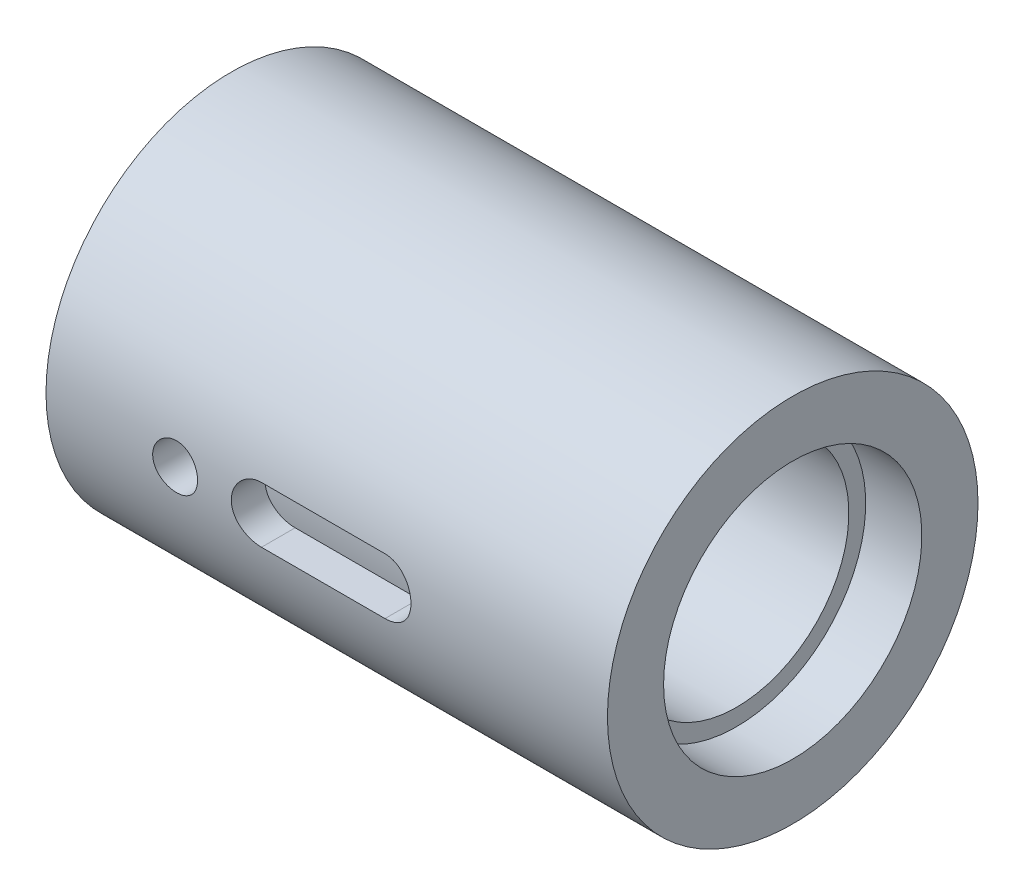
ISO-10303-21;
HEADER;
FILE_DESCRIPTION(('STEP AP214'),'2;1');
FILE_NAME('part.step','',(''),(''),'','','');
FILE_SCHEMA(('AUTOMOTIVE_DESIGN { 1 0 10303 214 1 1 1 1 }'));
ENDSEC;
DATA;
#1=APPLICATION_CONTEXT('core data for automotive mechanical design processes');
#2=APPLICATION_PROTOCOL_DEFINITION('international standard','automotive_design',2000,#1);
#3=PRODUCT_CONTEXT('',#1,'mechanical');
#4=PRODUCT('Part','Part','',(#3));
#5=PRODUCT_RELATED_PRODUCT_CATEGORY('part','',(#4));
#6=PRODUCT_DEFINITION_FORMATION('','',#4);
#7=PRODUCT_DEFINITION_CONTEXT('part definition',#1,'design');
#8=PRODUCT_DEFINITION('design','',#6,#7);
#9=PRODUCT_DEFINITION_SHAPE('','',#8);
#10=(LENGTH_UNIT() NAMED_UNIT(*) SI_UNIT(.MILLI.,.METRE.));
#11=(NAMED_UNIT(*) PLANE_ANGLE_UNIT() SI_UNIT($,.RADIAN.));
#12=(NAMED_UNIT(*) SI_UNIT($,.STERADIAN.) SOLID_ANGLE_UNIT());
#13=UNCERTAINTY_MEASURE_WITH_UNIT(LENGTH_MEASURE(1.E-05),#10,'distance_accuracy_value','');
#14=(GEOMETRIC_REPRESENTATION_CONTEXT(3) GLOBAL_UNCERTAINTY_ASSIGNED_CONTEXT((#13)) GLOBAL_UNIT_ASSIGNED_CONTEXT((#10,
#11,#12)) REPRESENTATION_CONTEXT('',''));
#15=CARTESIAN_POINT('',(0.,0.,0.));
#16=DIRECTION('',(0.,0.,1.));
#17=DIRECTION('',(1.,0.,0.));
#18=AXIS2_PLACEMENT_3D('',#15,#16,#17);
#19=CARTESIAN_POINT('',(25.,16.5,0.));
#20=DIRECTION('',(-1.,0.,0.));
#21=DIRECTION('',(0.,0.,1.));
#22=AXIS2_PLACEMENT_3D('',#19,#20,#21);
#23=PLANE('',#22);
#24=CARTESIAN_POINT('',(25.,0.,0.));
#25=DIRECTION('',(-1.,0.,0.));
#26=DIRECTION('',(0.,0.,1.));
#27=AXIS2_PLACEMENT_3D('',#24,#25,#26);
#28=CIRCLE('',#27,16.5);
#29=CARTESIAN_POINT('',(25.,0.,16.5));
#30=VERTEX_POINT('',#29);
#31=EDGE_CURVE('E112',#30,#30,#28,.T.);
#32=ORIENTED_EDGE('',*,*,#31,.F.);
#33=EDGE_LOOP('',(#32));
#34=FACE_BOUND('',#33,.T.);
#35=CARTESIAN_POINT('',(25.,0.,0.));
#36=DIRECTION('',(-1.,0.,0.));
#37=DIRECTION('',(0.,0.,1.));
#38=AXIS2_PLACEMENT_3D('',#35,#36,#37);
#39=CIRCLE('',#38,11.5);
#40=CARTESIAN_POINT('',(25.,0.,11.5));
#41=VERTEX_POINT('',#40);
#42=EDGE_CURVE('E91',#41,#41,#39,.T.);
#43=ORIENTED_EDGE('',*,*,#42,.T.);
#44=EDGE_LOOP('',(#43));
#45=FACE_BOUND('',#44,.T.);
#46=ADVANCED_FACE('F28',(#34,#45),#23,.F.);
#47=CARTESIAN_POINT('',(0.,0.,0.));
#48=DIRECTION('',(-1.,0.,0.));
#49=DIRECTION('',(0.,0.,1.));
#50=AXIS2_PLACEMENT_3D('',#47,#48,#49);
#51=CYLINDRICAL_SURFACE('',#50,16.5);
#52=CARTESIAN_POINT('',(-11.5,0.,16.5));
#53=CARTESIAN_POINT('',(-11.5000047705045,0.111900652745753,16.4999984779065));
#54=CARTESIAN_POINT('',(-11.5094229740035,0.223871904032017,16.4988496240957));
#55=CARTESIAN_POINT('',(-11.5468464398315,0.444700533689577,16.4943771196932));
#56=CARTESIAN_POINT('',(-11.5748712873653,0.553554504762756,16.4910511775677));
#57=CARTESIAN_POINT('',(-11.6486718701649,0.764919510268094,16.4825993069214));
#58=CARTESIAN_POINT('',(-11.6944358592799,0.867434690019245,16.4774745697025));
#59=CARTESIAN_POINT('',(-11.8023904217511,1.06330969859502,16.4659955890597));
#60=CARTESIAN_POINT('',(-11.8645781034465,1.15667113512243,16.4596415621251));
#61=CARTESIAN_POINT('',(-12.0039600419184,1.33209299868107,16.4463769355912));
#62=CARTESIAN_POINT('',(-12.081222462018,1.41409908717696,16.4394638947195));
#63=CARTESIAN_POINT('',(-12.2484144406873,1.56401456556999,16.4258801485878));
#64=CARTESIAN_POINT('',(-12.3383446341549,1.63192324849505,16.4192094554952));
#65=CARTESIAN_POINT('',(-12.52867056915,1.75191716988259,16.4068415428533));
#66=CARTESIAN_POINT('',(-12.6290984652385,1.80395175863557,16.4011474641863));
#67=CARTESIAN_POINT('',(-12.8373476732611,1.890396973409,16.3914094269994));
#68=CARTESIAN_POINT('',(-12.9451687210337,1.92480822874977,16.3873654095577));
#69=CARTESIAN_POINT('',(-13.1645809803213,1.97486543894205,16.3814085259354));
#70=CARTESIAN_POINT('',(-13.2761510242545,1.99060291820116,16.3794852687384));
#71=CARTESIAN_POINT('',(-13.5003639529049,2.00314900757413,16.3779558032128));
#72=CARTESIAN_POINT('',(-13.6130067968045,1.99995833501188,16.378349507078));
#73=CARTESIAN_POINT('',(-13.835531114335,1.9748138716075,16.3813999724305));
#74=CARTESIAN_POINT('',(-13.9454241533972,1.95296075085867,16.3840445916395));
#75=CARTESIAN_POINT('',(-14.1599716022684,1.89126871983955,16.3912799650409));
#76=CARTESIAN_POINT('',(-14.2646259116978,1.85142946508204,16.3958707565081));
#77=CARTESIAN_POINT('',(-14.4660387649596,1.7547873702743,16.4064950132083));
#78=CARTESIAN_POINT('',(-14.562776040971,1.69794063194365,16.4125322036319));
#79=CARTESIAN_POINT('',(-14.7453758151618,1.56892866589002,16.4253661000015));
#80=CARTESIAN_POINT('',(-14.8312378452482,1.49676277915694,16.4321628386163));
#81=CARTESIAN_POINT('',(-14.9902342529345,1.33860240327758,16.4458040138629));
#82=CARTESIAN_POINT('',(-15.0632823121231,1.25252111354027,16.4526484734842));
#83=CARTESIAN_POINT('',(-15.1939056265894,1.06927274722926,16.4655725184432));
#84=CARTESIAN_POINT('',(-15.2514808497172,0.97210564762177,16.4716521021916));
#85=CARTESIAN_POINT('',(-15.3495236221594,0.769378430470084,16.4823648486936));
#86=CARTESIAN_POINT('',(-15.3899859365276,0.663815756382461,16.4869975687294));
#87=CARTESIAN_POINT('',(-15.4525866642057,0.447325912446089,16.4942905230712));
#88=CARTESIAN_POINT('',(-15.4747258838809,0.336398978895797,16.4969508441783));
#89=CARTESIAN_POINT('',(-15.499940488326,0.113075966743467,16.4999879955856));
#90=CARTESIAN_POINT('',(-15.5031348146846,0.000693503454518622,16.5003790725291));
#91=CARTESIAN_POINT('',(-15.4906825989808,-0.223005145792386,16.4988720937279));
#92=CARTESIAN_POINT('',(-15.4750364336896,-0.334321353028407,16.4969740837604));
#93=CARTESIAN_POINT('',(-15.4254461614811,-0.552377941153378,16.4911111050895));
#94=CARTESIAN_POINT('',(-15.3915585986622,-0.659131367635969,16.48715252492));
#95=CARTESIAN_POINT('',(-15.3065061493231,-0.865439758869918,16.4776117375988));
#96=CARTESIAN_POINT('',(-15.2553407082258,-0.964994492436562,16.4720294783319));
#97=CARTESIAN_POINT('',(-15.1368959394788,-1.15461179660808,16.4598284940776));
#98=CARTESIAN_POINT('',(-15.0695394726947,-1.24462586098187,16.4532048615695));
#99=CARTESIAN_POINT('',(-14.9207340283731,-1.41211356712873,16.4396778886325));
#100=CARTESIAN_POINT('',(-14.8392845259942,-1.48958674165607,16.4327745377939));
#101=CARTESIAN_POINT('',(-14.66408193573,-1.63021400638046,16.4194223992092));
#102=CARTESIAN_POINT('',(-14.5702654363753,-1.69328937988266,16.4129762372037));
#103=CARTESIAN_POINT('',(-14.3733004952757,-1.80278720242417,16.4013110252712));
#104=CARTESIAN_POINT('',(-14.2701522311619,-1.84920996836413,16.3960919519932));
#105=CARTESIAN_POINT('',(-14.0577083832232,-1.9239566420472,16.3874895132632));
#106=CARTESIAN_POINT('',(-13.9484287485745,-1.95232533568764,16.384101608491));
#107=CARTESIAN_POINT('',(-13.7266133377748,-1.99030299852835,16.3795319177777));
#108=CARTESIAN_POINT('',(-13.6140777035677,-1.99991278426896,16.3783500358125));
#109=CARTESIAN_POINT('',(-13.3897277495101,-2.00008547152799,16.3783288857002));
#110=CARTESIAN_POINT('',(-13.2779135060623,-1.99077203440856,16.3794744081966));
#111=CARTESIAN_POINT('',(-13.0574518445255,-1.9536240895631,16.38394634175));
#112=CARTESIAN_POINT('',(-12.9488044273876,-1.92578957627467,16.387272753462));
#113=CARTESIAN_POINT('',(-12.7377742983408,-1.85242753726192,16.3957270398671));
#114=CARTESIAN_POINT('',(-12.6353896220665,-1.80690559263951,16.400854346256));
#115=CARTESIAN_POINT('',(-12.4396926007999,-1.69947310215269,16.4123336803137));
#116=CARTESIAN_POINT('',(-12.3463803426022,-1.63756239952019,16.4186857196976));
#117=CARTESIAN_POINT('',(-12.170844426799,-1.49864990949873,16.4319485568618));
#118=CARTESIAN_POINT('',(-12.0886939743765,-1.42155592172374,16.4388626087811));
#119=CARTESIAN_POINT('',(-11.9384477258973,-1.2546566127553,16.4524415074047));
#120=CARTESIAN_POINT('',(-11.8703552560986,-1.16484829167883,16.4591062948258));
#121=CARTESIAN_POINT('',(-11.7499521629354,-0.974702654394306,16.4714619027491));
#122=CARTESIAN_POINT('',(-11.6976989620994,-0.874328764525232,16.4771491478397));
#123=CARTESIAN_POINT('',(-11.6108634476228,-0.666219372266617,16.4868723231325));
#124=CARTESIAN_POINT('',(-11.576261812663,-0.558492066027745,16.4909100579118));
#125=CARTESIAN_POINT('',(-11.5340517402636,-0.375165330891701,16.4958990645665));
#126=CARTESIAN_POINT('',(-11.5213005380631,-0.300724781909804,16.4974294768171));
#127=CARTESIAN_POINT('',(-11.5042730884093,-0.150866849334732,16.4994804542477));
#128=CARTESIAN_POINT('',(-11.4999967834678,-0.075449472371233,16.5000010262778));
#129=CARTESIAN_POINT('',(-11.5,0.,16.5));
#130=B_SPLINE_CURVE_WITH_KNOTS('',3,(#52,#53,#54,#55,#56,#57,#58,#59,#60,#61,#62,#63,#64,#65,
#66,#67,#68,#69,#70,#71,#72,#73,#74,#75,#76,#77,#78,#79,#80,#81,#82,#83,#84,#85,#86,#87,#88,#89,
#90,#91,#92,#93,#94,#95,#96,#97,#98,#99,#100,#101,#102,#103,#104,#105,#106,#107,#108,#109,#110,
#111,#112,#113,#114,#115,#116,#117,#118,#119,#120,#121,#122,#123,#124,#125,#126,#127,#128,#129),
.UNSPECIFIED.,.T.,.F.,(4,2,2,2,2,2,2,2,2,2,2,2,2,2,2,2,2,2,2,2,2,2,2,2,2,2,2,2,2,2,2,2,2,2,2,2,
2,2,4),(0.,0.335426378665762,0.671206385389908,1.00676443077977,1.34226343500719,
1.6793161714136,2.01638580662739,2.35451994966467,2.69264201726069,3.02909993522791,
3.3655451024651,3.70018677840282,4.03483486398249,4.37035427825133,4.70588812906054,
5.04360200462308,5.38131658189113,5.71913439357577,6.05693733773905,6.39261719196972,
6.72829033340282,7.0629289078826,7.39757822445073,7.7338546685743,8.07014363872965,
8.40822935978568,8.74630864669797,9.08354597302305,9.42076861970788,9.75579463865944,
10.0908207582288,10.4257412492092,10.7606649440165,11.0976889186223,11.4347925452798,
11.7731040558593,12.111044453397,12.3372085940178,12.5633712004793),.UNSPECIFIED.);
#131=CARTESIAN_POINT('',(-11.5,0.,16.5));
#132=VERTEX_POINT('',#131);
#133=EDGE_CURVE('E280',#132,#132,#130,.T.);
#134=ORIENTED_EDGE('',*,*,#133,.F.);
#135=EDGE_LOOP('',(#134));
#136=FACE_BOUND('',#135,.T.);
#137=CARTESIAN_POINT('',(-3.49999999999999,0.,16.5));
#138=CARTESIAN_POINT('',(-3.5000057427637,-0.139568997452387,16.4999977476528));
#139=CARTESIAN_POINT('',(-3.51172716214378,-0.279218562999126,16.4982105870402));
#140=CARTESIAN_POINT('',(-3.55829060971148,-0.554613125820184,16.4912532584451));
#141=CARTESIAN_POINT('',(-3.59315504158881,-0.690354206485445,16.4860798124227));
#142=CARTESIAN_POINT('',(-3.68493786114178,-0.953906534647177,16.4729311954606));
#143=CARTESIAN_POINT('',(-3.74183946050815,-1.08172373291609,16.4649581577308));
#144=CARTESIAN_POINT('',(-3.87604010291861,-1.32597651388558,16.4470909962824));
#145=CARTESIAN_POINT('',(-3.95333635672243,-1.44241364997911,16.4371971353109));
#146=CARTESIAN_POINT('',(-4.12678797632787,-1.66154764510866,16.4165001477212));
#147=CARTESIAN_POINT('',(-4.22307373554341,-1.76414074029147,16.4056910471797));
#148=CARTESIAN_POINT('',(-4.43149056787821,-1.95177906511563,16.3844285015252));
#149=CARTESIAN_POINT('',(-4.54362255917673,-2.0368232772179,16.3739750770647));
#150=CARTESIAN_POINT('',(-4.78124739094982,-2.18735471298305,16.3545494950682));
#151=CARTESIAN_POINT('',(-4.90680463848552,-2.25274134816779,16.3455850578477));
#152=CARTESIAN_POINT('',(-5.16727790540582,-2.36145868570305,16.3302341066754));
#153=CARTESIAN_POINT('',(-5.3021934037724,-2.40479061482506,16.3238474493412));
#154=CARTESIAN_POINT('',(-5.57646137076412,-2.46784584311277,16.3144339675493));
#155=CARTESIAN_POINT('',(-5.71577208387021,-2.48774691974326,16.3113818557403));
#156=CARTESIAN_POINT('',(-5.99578651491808,-2.50392630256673,16.3089062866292));
#157=CARTESIAN_POINT('',(-6.1364901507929,-2.50020599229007,16.3094826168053));
#158=CARTESIAN_POINT('',(-6.4140393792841,-2.46939344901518,16.3141756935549));
#159=CARTESIAN_POINT('',(-6.55090755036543,-2.44249936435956,16.3182624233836));
#160=CARTESIAN_POINT('',(-6.81816600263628,-2.36641294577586,16.3294689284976));
#161=CARTESIAN_POINT('',(-6.94855609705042,-2.31721996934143,16.3365887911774));
#162=CARTESIAN_POINT('',(-7.19975913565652,-2.19772653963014,16.3530924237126));
#163=CARTESIAN_POINT('',(-7.32053161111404,-2.12734229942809,16.3624851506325));
#164=CARTESIAN_POINT('',(-7.5486268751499,-1.96752394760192,16.3824697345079));
#165=CARTESIAN_POINT('',(-7.65594876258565,-1.87808856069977,16.3930616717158));
#166=CARTESIAN_POINT('',(-7.85524464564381,-1.6816196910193,16.4143837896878));
#167=CARTESIAN_POINT('',(-7.94705077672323,-1.57441587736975,16.4251142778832));
#168=CARTESIAN_POINT('',(-8.11139423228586,-1.34603342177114,16.4454040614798));
#169=CARTESIAN_POINT('',(-8.18393146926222,-1.22485471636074,16.454963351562));
#170=CARTESIAN_POINT('',(-8.30768728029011,-0.971815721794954,16.4718439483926));
#171=CARTESIAN_POINT('',(-8.35889273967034,-0.839948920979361,16.4791638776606));
#172=CARTESIAN_POINT('',(-8.43838466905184,-0.569352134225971,16.4907295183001));
#173=CARTESIAN_POINT('',(-8.46667272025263,-0.430622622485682,16.4949754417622));
#174=CARTESIAN_POINT('',(-8.4993032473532,-0.151687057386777,16.4998865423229));
#175=CARTESIAN_POINT('',(-8.5038764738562,-0.011508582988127,16.5005862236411));
#176=CARTESIAN_POINT('',(-8.48956025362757,0.267613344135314,16.49841997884));
#177=CARTESIAN_POINT('',(-8.470671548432,0.406556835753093,16.4955541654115));
#178=CARTESIAN_POINT('',(-8.41015953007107,0.678564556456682,16.4866002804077));
#179=CARTESIAN_POINT('',(-8.36864879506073,0.811654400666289,16.4805281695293));
#180=CARTESIAN_POINT('',(-8.2641898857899,1.068985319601,16.4658402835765));
#181=CARTESIAN_POINT('',(-8.20124068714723,1.19322597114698,16.4572243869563));
#182=CARTESIAN_POINT('',(-8.05515151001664,1.43034535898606,16.4383205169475));
#183=CARTESIAN_POINT('',(-7.97186535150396,1.54313306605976,16.4280206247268));
#184=CARTESIAN_POINT('',(-7.78766975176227,1.75321276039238,16.4069318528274));
#185=CARTESIAN_POINT('',(-7.68675926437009,1.85050382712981,16.3961429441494));
#186=CARTESIAN_POINT('',(-7.46915155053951,2.02766949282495,16.3751825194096));
#187=CARTESIAN_POINT('',(-7.3523276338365,2.10738930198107,16.3650170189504));
#188=CARTESIAN_POINT('',(-7.10681141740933,2.24607312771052,16.3465614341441));
#189=CARTESIAN_POINT('',(-6.97811944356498,2.30503771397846,16.3382712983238));
#190=CARTESIAN_POINT('',(-6.71297927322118,2.40029812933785,16.324548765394));
#191=CARTESIAN_POINT('',(-6.5765607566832,2.43667503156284,16.3191061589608));
#192=CARTESIAN_POINT('',(-6.29946186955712,2.48598526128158,16.3116678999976));
#193=CARTESIAN_POINT('',(-6.15878180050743,2.49892024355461,16.3096720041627));
#194=CARTESIAN_POINT('',(-5.87869627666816,2.50093949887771,16.3093623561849));
#195=CARTESIAN_POINT('',(-5.73929255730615,2.49026717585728,16.3110110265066));
#196=CARTESIAN_POINT('',(-5.46428707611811,2.4458967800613,16.3177230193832));
#197=CARTESIAN_POINT('',(-5.32868530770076,2.41219874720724,16.3227863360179));
#198=CARTESIAN_POINT('',(-5.06520274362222,2.32282019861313,16.3357438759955));
#199=CARTESIAN_POINT('',(-4.9373159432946,2.26715703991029,16.3436358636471));
#200=CARTESIAN_POINT('',(-4.69265697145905,2.13545259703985,16.3613641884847));
#201=CARTESIAN_POINT('',(-4.57588519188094,2.05941059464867,16.3712005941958));
#202=CARTESIAN_POINT('',(-4.35553492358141,1.88822405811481,16.3918301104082));
#203=CARTESIAN_POINT('',(-4.25209718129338,1.79289935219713,16.4026316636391));
#204=CARTESIAN_POINT('',(-4.06259995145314,1.586234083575,16.4239042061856));
#205=CARTESIAN_POINT('',(-3.97654450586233,1.47488980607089,16.4343751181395));
#206=CARTESIAN_POINT('',(-3.82382149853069,1.23860885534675,16.4538739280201));
#207=CARTESIAN_POINT('',(-3.75726565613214,1.11359928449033,16.4628933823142));
#208=CARTESIAN_POINT('',(-3.64619536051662,0.85409719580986,16.4783903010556));
#209=CARTESIAN_POINT('',(-3.60165815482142,0.719614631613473,16.4848703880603));
#210=CARTESIAN_POINT('',(-3.54595532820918,0.487113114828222,16.4930848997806));
#211=CARTESIAN_POINT('',(-3.52874852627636,0.390526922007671,16.4956646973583));
#212=CARTESIAN_POINT('',(-3.50576891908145,0.195973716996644,16.4991230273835));
#213=CARTESIAN_POINT('',(-3.49999596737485,0.0980067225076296,16.5000015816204));
#214=CARTESIAN_POINT('',(-3.49999999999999,0.,16.5));
#215=B_SPLINE_CURVE_WITH_KNOTS('',3,(#137,#138,#139,#140,#141,#142,#143,#144,#145,#146,#147,
#148,#149,#150,#151,#152,#153,#154,#155,#156,#157,#158,#159,#160,#161,#162,#163,#164,#165,#166,
#167,#168,#169,#170,#171,#172,#173,#174,#175,#176,#177,#178,#179,#180,#181,#182,#183,#184,#185,
#186,#187,#188,#189,#190,#191,#192,#193,#194,#195,#196,#197,#198,#199,#200,#201,#202,#203,#204,
#205,#206,#207,#208,#209,#210,#211,#212,#213,#214),.UNSPECIFIED.,.T.,.F.,(4,2,2,2,2,2,2,2,2,2,2,
2,2,2,2,2,2,2,2,2,2,2,2,2,2,2,2,2,2,2,2,2,2,2,2,2,2,2,4),(0.,0.418348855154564,
0.837103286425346,1.25553932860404,1.67391817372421,2.09527670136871,2.51665965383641,
2.94016350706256,3.36364380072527,3.7838898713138,4.20411132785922,4.6207749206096,
5.03745051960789,5.45579571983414,5.87416893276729,6.29681313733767,6.7194592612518,
7.1423648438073,7.56524124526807,7.98399513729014,8.40273579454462,8.81941137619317,
9.23610687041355,9.65589057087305,10.0756991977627,10.4990700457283,10.9224292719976,
11.3442600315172,11.7660610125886,12.1835332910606,12.6010048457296,13.0181471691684,
13.4353041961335,13.8565557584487,14.2779051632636,14.701623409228,15.1249028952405,
15.4186753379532,15.7124440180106),.UNSPECIFIED.);
#216=CARTESIAN_POINT('',(-6.,-2.5,16.3095064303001));
#217=VERTEX_POINT('',#216);
#218=CARTESIAN_POINT('',(-6.,2.5,16.3095064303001));
#219=VERTEX_POINT('',#218);
#220=EDGE_CURVE('E35',#217,#219,#215,.T.);
#221=ORIENTED_EDGE('',*,*,#220,.T.);
#222=DIRECTION('',(-1.,0.,0.));
#223=VECTOR('',#222,1.);
#224=CARTESIAN_POINT('',(0.,2.5,16.3095064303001));
#225=LINE('',#224,#223);
#226=CARTESIAN_POINT('',(5.,2.5,16.3095064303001));
#227=VERTEX_POINT('',#226);
#228=EDGE_CURVE('E11',#219,#227,#225,.F.);
#229=ORIENTED_EDGE('',*,*,#228,.T.);
#230=CARTESIAN_POINT('',(7.50000000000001,0.,16.5));
#231=CARTESIAN_POINT('',(7.4999942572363,-0.139568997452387,16.4999977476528));
#232=CARTESIAN_POINT('',(7.48827283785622,-0.279218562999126,16.4982105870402));
#233=CARTESIAN_POINT('',(7.44170939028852,-0.554613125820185,16.4912532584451));
#234=CARTESIAN_POINT('',(7.40684495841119,-0.690354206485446,16.4860798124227));
#235=CARTESIAN_POINT('',(7.31506213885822,-0.953906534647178,16.4729311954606));
#236=CARTESIAN_POINT('',(7.25816053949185,-1.08172373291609,16.4649581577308));
#237=CARTESIAN_POINT('',(7.12395989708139,-1.32597651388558,16.4470909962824));
#238=CARTESIAN_POINT('',(7.04666364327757,-1.44241364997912,16.4371971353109));
#239=CARTESIAN_POINT('',(6.87321202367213,-1.66154764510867,16.4165001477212));
#240=CARTESIAN_POINT('',(6.77692626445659,-1.76414074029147,16.4056910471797));
#241=CARTESIAN_POINT('',(6.56850943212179,-1.95177906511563,16.3844285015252));
#242=CARTESIAN_POINT('',(6.45637744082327,-2.0368232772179,16.3739750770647));
#243=CARTESIAN_POINT('',(6.21875260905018,-2.18735471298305,16.3545494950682));
#244=CARTESIAN_POINT('',(6.09319536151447,-2.25274134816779,16.3455850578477));
#245=CARTESIAN_POINT('',(5.83272209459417,-2.36145868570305,16.3302341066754));
#246=CARTESIAN_POINT('',(5.69780659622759,-2.40479061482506,16.3238474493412));
#247=CARTESIAN_POINT('',(5.42353862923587,-2.46784584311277,16.3144339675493));
#248=CARTESIAN_POINT('',(5.28422791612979,-2.48774691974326,16.3113818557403));
#249=CARTESIAN_POINT('',(5.00421348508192,-2.50392630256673,16.3089062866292));
#250=CARTESIAN_POINT('',(4.8635098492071,-2.50020599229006,16.3094826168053));
#251=CARTESIAN_POINT('',(4.5859606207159,-2.46939344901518,16.3141756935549));
#252=CARTESIAN_POINT('',(4.44909244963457,-2.44249936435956,16.3182624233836));
#253=CARTESIAN_POINT('',(4.18183399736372,-2.36641294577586,16.3294689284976));
#254=CARTESIAN_POINT('',(4.05144390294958,-2.31721996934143,16.3365887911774));
#255=CARTESIAN_POINT('',(3.80024086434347,-2.19772653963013,16.3530924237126));
#256=CARTESIAN_POINT('',(3.67946838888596,-2.12734229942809,16.3624851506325));
#257=CARTESIAN_POINT('',(3.4513731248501,-1.96752394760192,16.3824697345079));
#258=CARTESIAN_POINT('',(3.34405123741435,-1.87808856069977,16.3930616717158));
#259=CARTESIAN_POINT('',(3.14475535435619,-1.6816196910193,16.4143837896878));
#260=CARTESIAN_POINT('',(3.05294922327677,-1.57441587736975,16.4251142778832));
#261=CARTESIAN_POINT('',(2.88860576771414,-1.34603342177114,16.4454040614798));
#262=CARTESIAN_POINT('',(2.81606853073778,-1.22485471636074,16.454963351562));
#263=CARTESIAN_POINT('',(2.69231271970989,-0.97181572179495,16.4718439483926));
#264=CARTESIAN_POINT('',(2.64110726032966,-0.839948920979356,16.4791638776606));
#265=CARTESIAN_POINT('',(2.56161533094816,-0.569352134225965,16.4907295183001));
#266=CARTESIAN_POINT('',(2.53332727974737,-0.430622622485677,16.4949754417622));
#267=CARTESIAN_POINT('',(2.5006967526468,-0.151687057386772,16.4998865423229));
#268=CARTESIAN_POINT('',(2.4961235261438,-0.0115085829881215,16.5005862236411));
#269=CARTESIAN_POINT('',(2.51043974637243,0.267613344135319,16.49841997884));
#270=CARTESIAN_POINT('',(2.529328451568,0.406556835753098,16.4955541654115));
#271=CARTESIAN_POINT('',(2.58984046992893,0.678564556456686,16.4866002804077));
#272=CARTESIAN_POINT('',(2.63135120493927,0.811654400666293,16.4805281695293));
#273=CARTESIAN_POINT('',(2.7358101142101,1.068985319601,16.4658402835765));
#274=CARTESIAN_POINT('',(2.79875931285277,1.19322597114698,16.4572243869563));
#275=CARTESIAN_POINT('',(2.94484848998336,1.43034535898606,16.4383205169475));
#276=CARTESIAN_POINT('',(3.02813464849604,1.54313306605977,16.4280206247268));
#277=CARTESIAN_POINT('',(3.21233024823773,1.75321276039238,16.4069318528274));
#278=CARTESIAN_POINT('',(3.31324073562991,1.85050382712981,16.3961429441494));
#279=CARTESIAN_POINT('',(3.53084844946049,2.02766949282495,16.3751825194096));
#280=CARTESIAN_POINT('',(3.6476723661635,2.10738930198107,16.3650170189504));
#281=CARTESIAN_POINT('',(3.89318858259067,2.24607312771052,16.3465614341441));
#282=CARTESIAN_POINT('',(4.02188055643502,2.30503771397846,16.3382712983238));
#283=CARTESIAN_POINT('',(4.28702072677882,2.40029812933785,16.324548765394));
#284=CARTESIAN_POINT('',(4.42343924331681,2.43667503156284,16.3191061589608));
#285=CARTESIAN_POINT('',(4.70053813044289,2.48598526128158,16.3116678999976));
#286=CARTESIAN_POINT('',(4.84121819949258,2.49892024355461,16.3096720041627));
#287=CARTESIAN_POINT('',(5.12130372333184,2.50093949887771,16.3093623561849));
#288=CARTESIAN_POINT('',(5.26070744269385,2.49026717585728,16.3110110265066));
#289=CARTESIAN_POINT('',(5.53571292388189,2.4458967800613,16.3177230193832));
#290=CARTESIAN_POINT('',(5.67131469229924,2.41219874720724,16.3227863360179));
#291=CARTESIAN_POINT('',(5.93479725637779,2.32282019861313,16.3357438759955));
#292=CARTESIAN_POINT('',(6.0626840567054,2.26715703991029,16.3436358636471));
#293=CARTESIAN_POINT('',(6.30734302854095,2.13545259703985,16.3613641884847));
#294=CARTESIAN_POINT('',(6.42411480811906,2.05941059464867,16.3712005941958));
#295=CARTESIAN_POINT('',(6.6444650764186,1.88822405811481,16.3918301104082));
#296=CARTESIAN_POINT('',(6.74790281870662,1.79289935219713,16.4026316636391));
#297=CARTESIAN_POINT('',(6.93740004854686,1.586234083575,16.4239042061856));
#298=CARTESIAN_POINT('',(7.02345549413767,1.47488980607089,16.4343751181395));
#299=CARTESIAN_POINT('',(7.17617850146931,1.23860885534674,16.4538739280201));
#300=CARTESIAN_POINT('',(7.24273434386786,1.11359928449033,16.4628933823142));
#301=CARTESIAN_POINT('',(7.35380463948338,0.854097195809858,16.4783903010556));
#302=CARTESIAN_POINT('',(7.39834184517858,0.719614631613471,16.4848703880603));
#303=CARTESIAN_POINT('',(7.45404467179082,0.48711311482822,16.4930848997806));
#304=CARTESIAN_POINT('',(7.47125147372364,0.390526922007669,16.4956646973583));
#305=CARTESIAN_POINT('',(7.49423108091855,0.195973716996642,16.4991230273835));
#306=CARTESIAN_POINT('',(7.50000403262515,0.098006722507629,16.5000015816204));
#307=CARTESIAN_POINT('',(7.50000000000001,0.,16.5));
#308=B_SPLINE_CURVE_WITH_KNOTS('',3,(#230,#231,#232,#233,#234,#235,#236,#237,#238,#239,#240,
#241,#242,#243,#244,#245,#246,#247,#248,#249,#250,#251,#252,#253,#254,#255,#256,#257,#258,#259,
#260,#261,#262,#263,#264,#265,#266,#267,#268,#269,#270,#271,#272,#273,#274,#275,#276,#277,#278,
#279,#280,#281,#282,#283,#284,#285,#286,#287,#288,#289,#290,#291,#292,#293,#294,#295,#296,#297,
#298,#299,#300,#301,#302,#303,#304,#305,#306,#307),.UNSPECIFIED.,.T.,.F.,(4,2,2,2,2,2,2,2,2,2,2,
2,2,2,2,2,2,2,2,2,2,2,2,2,2,2,2,2,2,2,2,2,2,2,2,2,2,2,4),(0.,0.418348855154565,
0.837103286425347,1.25553932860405,1.67391817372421,2.09527670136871,2.51665965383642,
2.94016350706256,3.36364380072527,3.7838898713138,4.20411132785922,4.6207749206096,
5.03745051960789,5.45579571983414,5.87416893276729,6.29681313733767,6.7194592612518,
7.1423648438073,7.56524124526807,7.98399513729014,8.40273579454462,8.81941137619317,
9.23610687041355,9.65589057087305,10.0756991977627,10.4990700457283,10.9224292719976,
11.3442600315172,11.7660610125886,12.1835332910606,12.6010048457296,13.0181471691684,
13.4353041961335,13.8565557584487,14.2779051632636,14.701623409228,15.1249028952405,
15.4186753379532,15.7124440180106),.UNSPECIFIED.);
#309=CARTESIAN_POINT('',(5.,-2.5,16.3095064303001));
#310=VERTEX_POINT('',#309);
#311=EDGE_CURVE('E115',#227,#310,#308,.T.);
#312=ORIENTED_EDGE('',*,*,#311,.T.);
#313=DIRECTION('',(-1.,0.,0.));
#314=VECTOR('',#313,1.);
#315=CARTESIAN_POINT('',(0.,-2.5,16.3095064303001));
#316=LINE('',#315,#314);
#317=EDGE_CURVE('E121',#310,#217,#316,.T.);
#318=ORIENTED_EDGE('',*,*,#317,.T.);
#319=EDGE_LOOP('',(#221,#229,#312,#318));
#320=FACE_BOUND('',#319,.T.);
#321=CARTESIAN_POINT('',(-25.,0.,0.));
#322=DIRECTION('',(-1.,0.,0.));
#323=DIRECTION('',(0.,0.,1.));
#324=AXIS2_PLACEMENT_3D('',#321,#322,#323);
#325=CIRCLE('',#324,16.5);
#326=CARTESIAN_POINT('',(-25.,0.,16.5));
#327=VERTEX_POINT('',#326);
#328=EDGE_CURVE('E109',#327,#327,#325,.T.);
#329=ORIENTED_EDGE('',*,*,#328,.F.);
#330=EDGE_LOOP('',(#329));
#331=FACE_BOUND('',#330,.T.);
#332=ORIENTED_EDGE('',*,*,#31,.T.);
#333=EDGE_LOOP('',(#332));
#334=FACE_BOUND('',#333,.T.);
#335=ADVANCED_FACE('F122',(#136,#320,#331,#334),#51,.T.);
#336=CARTESIAN_POINT('',(-25.,16.5,0.));
#337=DIRECTION('',(1.,0.,0.));
#338=DIRECTION('',(0.,0.,-1.));
#339=AXIS2_PLACEMENT_3D('',#336,#337,#338);
#340=PLANE('',#339);
#341=CARTESIAN_POINT('',(-25.,0.,0.));
#342=DIRECTION('',(-1.,0.,0.));
#343=DIRECTION('',(0.,0.,1.));
#344=AXIS2_PLACEMENT_3D('',#341,#342,#343);
#345=CIRCLE('',#344,11.5);
#346=CARTESIAN_POINT('',(-25.,0.,11.5));
#347=VERTEX_POINT('',#346);
#348=EDGE_CURVE('E106',#347,#347,#345,.T.);
#349=ORIENTED_EDGE('',*,*,#348,.F.);
#350=EDGE_LOOP('',(#349));
#351=FACE_BOUND('',#350,.T.);
#352=ORIENTED_EDGE('',*,*,#328,.T.);
#353=EDGE_LOOP('',(#352));
#354=FACE_BOUND('',#353,.T.);
#355=ADVANCED_FACE('F176',(#351,#354),#340,.F.);
#356=CARTESIAN_POINT('',(0.,0.,0.));
#357=DIRECTION('',(-1.,0.,0.));
#358=DIRECTION('',(0.,0.,1.));
#359=AXIS2_PLACEMENT_3D('',#356,#357,#358);
#360=CYLINDRICAL_SURFACE('',#359,11.5);
#361=CARTESIAN_POINT('',(-20.,0.,0.));
#362=DIRECTION('',(-1.,0.,0.));
#363=DIRECTION('',(0.,0.,1.));
#364=AXIS2_PLACEMENT_3D('',#361,#362,#363);
#365=CIRCLE('',#364,11.5);
#366=CARTESIAN_POINT('',(-20.,0.,11.5));
#367=VERTEX_POINT('',#366);
#368=EDGE_CURVE('E103',#367,#367,#365,.T.);
#369=ORIENTED_EDGE('',*,*,#368,.F.);
#370=EDGE_LOOP('',(#369));
#371=FACE_BOUND('',#370,.T.);
#372=ORIENTED_EDGE('',*,*,#348,.T.);
#373=EDGE_LOOP('',(#372));
#374=FACE_BOUND('',#373,.T.);
#375=ADVANCED_FACE('F201',(#371,#374),#360,.F.);
#376=CARTESIAN_POINT('',(-20.,11.5,0.));
#377=DIRECTION('',(1.,0.,0.));
#378=DIRECTION('',(0.,0.,-1.));
#379=AXIS2_PLACEMENT_3D('',#376,#377,#378);
#380=PLANE('',#379);
#381=CARTESIAN_POINT('',(-20.,0.,0.));
#382=DIRECTION('',(-1.,0.,0.));
#383=DIRECTION('',(0.,0.,1.));
#384=AXIS2_PLACEMENT_3D('',#381,#382,#383);
#385=CIRCLE('',#384,9.99999999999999);
#386=CARTESIAN_POINT('',(-20.,0.,9.99999999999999));
#387=VERTEX_POINT('',#386);
#388=EDGE_CURVE('E100',#387,#387,#385,.T.);
#389=ORIENTED_EDGE('',*,*,#388,.F.);
#390=EDGE_LOOP('',(#389));
#391=FACE_BOUND('',#390,.T.);
#392=ORIENTED_EDGE('',*,*,#368,.T.);
#393=EDGE_LOOP('',(#392));
#394=FACE_BOUND('',#393,.T.);
#395=ADVANCED_FACE('F194',(#391,#394),#380,.F.);
#396=CARTESIAN_POINT('',(0.,0.,0.));
#397=DIRECTION('',(-1.,0.,0.));
#398=DIRECTION('',(0.,0.,1.));
#399=AXIS2_PLACEMENT_3D('',#396,#397,#398);
#400=CYLINDRICAL_SURFACE('',#399,9.99999999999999);
#401=CARTESIAN_POINT('',(-11.5,0.,9.99999999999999));
#402=CARTESIAN_POINT('',(-11.5000040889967,-0.111153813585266,9.99999795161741));
#403=CARTESIAN_POINT('',(-11.5092976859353,-0.222359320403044,9.99812770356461));
#404=CARTESIAN_POINT('',(-11.5461970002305,-0.441627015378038,9.99084731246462));
#405=CARTESIAN_POINT('',(-11.573817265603,-0.549686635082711,9.98543435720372));
#406=CARTESIAN_POINT('',(-11.6464825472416,-0.759460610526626,9.97167298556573));
#407=CARTESIAN_POINT('',(-11.6915108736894,-0.861180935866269,9.96332738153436));
#408=CARTESIAN_POINT('',(-11.7976644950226,-1.05561597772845,9.94460796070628));
#409=CARTESIAN_POINT('',(-11.8587888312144,-1.14833123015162,9.93423426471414));
#410=CARTESIAN_POINT('',(-11.9962769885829,-1.32338695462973,9.91244330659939));
#411=CARTESIAN_POINT('',(-12.0728167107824,-1.40558790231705,9.90101491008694));
#412=CARTESIAN_POINT('',(-12.2385848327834,-1.55607351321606,9.87848360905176));
#413=CARTESIAN_POINT('',(-12.3278142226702,-1.62435708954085,9.86738073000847));
#414=CARTESIAN_POINT('',(-12.5174323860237,-1.74566350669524,9.8466488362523));
#415=CARTESIAN_POINT('',(-12.6179152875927,-1.79854187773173,9.83703414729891));
#416=CARTESIAN_POINT('',(-12.8265636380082,-1.88661133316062,9.82052536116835));
#417=CARTESIAN_POINT('',(-12.9347283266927,-1.92180416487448,9.81363099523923));
#418=CARTESIAN_POINT('',(-13.1541687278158,-1.97305059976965,9.80345610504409));
#419=CARTESIAN_POINT('',(-13.2653850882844,-1.98934899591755,9.80012940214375));
#420=CARTESIAN_POINT('',(-13.4890196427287,-2.00310425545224,9.79732750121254));
#421=CARTESIAN_POINT('',(-13.6014377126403,-2.000563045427,9.79785190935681));
#422=CARTESIAN_POINT('',(-13.822493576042,-1.97690914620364,9.80265102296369));
#423=CARTESIAN_POINT('',(-13.9311628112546,-1.95607708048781,9.80686905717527));
#424=CARTESIAN_POINT('',(-14.143432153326,-1.8968757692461,9.81849092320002));
#425=CARTESIAN_POINT('',(-14.247032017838,-1.85850568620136,9.82589490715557));
#426=CARTESIAN_POINT('',(-14.4470305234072,-1.76504956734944,9.84311237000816));
#427=CARTESIAN_POINT('',(-14.5433757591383,-1.70985230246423,9.85294179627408));
#428=CARTESIAN_POINT('',(-14.7255416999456,-1.58438714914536,9.87389237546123));
#429=CARTESIAN_POINT('',(-14.8113611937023,-1.51411752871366,9.88501367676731));
#430=CARTESIAN_POINT('',(-14.9716588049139,-1.35899986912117,9.90754042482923));
#431=CARTESIAN_POINT('',(-15.0459051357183,-1.27391232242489,9.91894738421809));
#432=CARTESIAN_POINT('',(-15.1791076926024,-1.09237004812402,9.94057697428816));
#433=CARTESIAN_POINT('',(-15.2380637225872,-0.995915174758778,9.95079958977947));
#434=CARTESIAN_POINT('',(-15.3390550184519,-0.794118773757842,9.96893380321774));
#435=CARTESIAN_POINT('',(-15.3810637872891,-0.688763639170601,9.97684177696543));
#436=CARTESIAN_POINT('',(-15.4467209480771,-0.47229795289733,9.98942817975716));
#437=CARTESIAN_POINT('',(-15.4703715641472,-0.361188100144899,9.99410700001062));
#438=CARTESIAN_POINT('',(-15.4983129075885,-0.138358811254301,9.99965343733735));
#439=CARTESIAN_POINT('',(-15.5029208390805,-0.0266806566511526,10.0005834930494));
#440=CARTESIAN_POINT('',(-15.4935002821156,0.195849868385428,9.99870103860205));
#441=CARTESIAN_POINT('',(-15.4794728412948,0.306702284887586,9.99588873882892));
#442=CARTESIAN_POINT('',(-15.4334432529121,0.523411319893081,9.98687664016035));
#443=CARTESIAN_POINT('',(-15.4016038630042,0.629303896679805,9.98070752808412));
#444=CARTESIAN_POINT('',(-15.3210320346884,0.834247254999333,9.96567104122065));
#445=CARTESIAN_POINT('',(-15.2722983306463,0.933297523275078,9.95680346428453));
#446=CARTESIAN_POINT('',(-15.1586350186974,1.12308234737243,9.93719823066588));
#447=CARTESIAN_POINT('',(-15.0935144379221,1.21370025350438,9.92643900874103));
#448=CARTESIAN_POINT('',(-14.9491816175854,1.38283603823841,9.90429469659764));
#449=CARTESIAN_POINT('',(-14.8699678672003,1.46135261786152,9.89290953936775));
#450=CARTESIAN_POINT('',(-14.6982532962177,1.60528118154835,9.87058607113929));
#451=CARTESIAN_POINT('',(-14.6055685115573,1.67047540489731,9.85965720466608));
#452=CARTESIAN_POINT('',(-14.4103772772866,1.78437084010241,9.83968383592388));
#453=CARTESIAN_POINT('',(-14.3078712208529,1.83307271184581,9.83063925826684));
#454=CARTESIAN_POINT('',(-14.0964635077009,1.91230368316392,9.81553481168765));
#455=CARTESIAN_POINT('',(-13.9875983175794,1.9429269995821,9.80945949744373));
#456=CARTESIAN_POINT('',(-13.7661330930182,1.98541730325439,9.8009487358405));
#457=CARTESIAN_POINT('',(-13.6535335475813,1.99728673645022,9.79851281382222));
#458=CARTESIAN_POINT('',(-13.4299822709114,2.00184182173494,9.79758299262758));
#459=CARTESIAN_POINT('',(-13.319037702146,1.99487157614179,9.79901838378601));
#460=CARTESIAN_POINT('',(-13.0999367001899,1.96270460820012,9.80551146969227));
#461=CARTESIAN_POINT('',(-12.9917802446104,1.9375080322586,9.81056913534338));
#462=CARTESIAN_POINT('',(-12.7815445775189,1.86975713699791,9.82370528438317));
#463=CARTESIAN_POINT('',(-12.6794512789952,1.82724501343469,9.83177642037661));
#464=CARTESIAN_POINT('',(-12.4837925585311,1.72610928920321,9.8500342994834));
#465=CARTESIAN_POINT('',(-12.3902278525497,1.66748433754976,9.86022121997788));
#466=CARTESIAN_POINT('',(-12.2125688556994,1.53461182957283,9.8817792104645));
#467=CARTESIAN_POINT('',(-12.1286624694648,1.46011577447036,9.89316745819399));
#468=CARTESIAN_POINT('',(-11.9744275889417,1.29812873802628,9.91572163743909));
#469=CARTESIAN_POINT('',(-11.9041022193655,1.21063477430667,9.92688751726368));
#470=CARTESIAN_POINT('',(-11.7783307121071,1.02403525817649,9.94787664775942));
#471=CARTESIAN_POINT('',(-11.7230479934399,0.924817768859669,9.95768462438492));
#472=CARTESIAN_POINT('',(-11.6300277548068,0.718332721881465,9.97470250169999));
#473=CARTESIAN_POINT('',(-11.592274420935,0.611072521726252,9.98191474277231));
#474=CARTESIAN_POINT('',(-11.5426961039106,0.419642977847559,9.99152745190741));
#475=CARTESIAN_POINT('',(-11.5267136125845,0.336563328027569,9.99468606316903));
#476=CARTESIAN_POINT('',(-11.5053641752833,0.168999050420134,9.99892308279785));
#477=CARTESIAN_POINT('',(-11.4999968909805,0.084514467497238,10.0000015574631));
#478=CARTESIAN_POINT('',(-11.5,0.,9.99999999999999));
#479=B_SPLINE_CURVE_WITH_KNOTS('',3,(#401,#402,#403,#404,#405,#406,#407,#408,#409,#410,#411,
#412,#413,#414,#415,#416,#417,#418,#419,#420,#421,#422,#423,#424,#425,#426,#427,#428,#429,#430,
#431,#432,#433,#434,#435,#436,#437,#438,#439,#440,#441,#442,#443,#444,#445,#446,#447,#448,#449,
#450,#451,#452,#453,#454,#455,#456,#457,#458,#459,#460,#461,#462,#463,#464,#465,#466,#467,#468,
#469,#470,#471,#472,#473,#474,#475,#476,#477,#478),.UNSPECIFIED.,.T.,.F.,(4,2,2,2,2,2,2,2,2,2,2,
2,2,2,2,2,2,2,2,2,2,2,2,2,2,2,2,2,2,2,2,2,2,2,2,2,2,2,4),(0.,0.333152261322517,
0.666569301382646,0.999667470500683,1.33274580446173,1.66986534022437,2.00701119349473,
2.34722390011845,2.68740298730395,3.02312370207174,3.3588100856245,3.68943454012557,
4.02007478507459,4.35294980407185,4.68586309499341,5.02476504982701,5.3636713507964,
5.70310549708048,6.04249851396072,6.3762147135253,6.70991215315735,7.04060907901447,
7.37133078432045,7.70610132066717,8.0409077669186,8.38081257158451,8.72070377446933,
9.05880762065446,9.39686736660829,9.72879445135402,10.0607188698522,10.3918392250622,
10.7229873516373,11.0597615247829,11.3966130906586,11.7369899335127,12.0770591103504,
12.3303755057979,12.5836838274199),.UNSPECIFIED.);
#480=CARTESIAN_POINT('',(-11.5,0.,9.99999999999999));
#481=VERTEX_POINT('',#480);
#482=EDGE_CURVE('E154',#481,#481,#479,.T.);
#483=ORIENTED_EDGE('',*,*,#482,.F.);
#484=EDGE_LOOP('',(#483));
#485=FACE_BOUND('',#484,.T.);
#486=CARTESIAN_POINT('',(20.,0.,0.));
#487=DIRECTION('',(-1.,0.,0.));
#488=DIRECTION('',(0.,0.,1.));
#489=AXIS2_PLACEMENT_3D('',#486,#487,#488);
#490=CIRCLE('',#489,9.99999999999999);
#491=CARTESIAN_POINT('',(20.,0.,9.99999999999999));
#492=VERTEX_POINT('',#491);
#493=EDGE_CURVE('E97',#492,#492,#490,.T.);
#494=ORIENTED_EDGE('',*,*,#493,.F.);
#495=EDGE_LOOP('',(#494));
#496=FACE_BOUND('',#495,.T.);
#497=ORIENTED_EDGE('',*,*,#388,.T.);
#498=EDGE_LOOP('',(#497));
#499=FACE_BOUND('',#498,.T.);
#500=ADVANCED_FACE('F189',(#485,#496,#499),#400,.F.);
#501=CARTESIAN_POINT('',(20.,11.5,0.));
#502=DIRECTION('',(-1.,0.,0.));
#503=DIRECTION('',(0.,0.,1.));
#504=AXIS2_PLACEMENT_3D('',#501,#502,#503);
#505=PLANE('',#504);
#506=CARTESIAN_POINT('',(20.,0.,0.));
#507=DIRECTION('',(-1.,0.,0.));
#508=DIRECTION('',(0.,0.,1.));
#509=AXIS2_PLACEMENT_3D('',#506,#507,#508);
#510=CIRCLE('',#509,11.5);
#511=CARTESIAN_POINT('',(20.,0.,11.5));
#512=VERTEX_POINT('',#511);
#513=EDGE_CURVE('E94',#512,#512,#510,.T.);
#514=ORIENTED_EDGE('',*,*,#513,.F.);
#515=EDGE_LOOP('',(#514));
#516=FACE_BOUND('',#515,.T.);
#517=ORIENTED_EDGE('',*,*,#493,.T.);
#518=EDGE_LOOP('',(#517));
#519=FACE_BOUND('',#518,.T.);
#520=ADVANCED_FACE('F184',(#516,#519),#505,.F.);
#521=CARTESIAN_POINT('',(0.,0.,0.));
#522=DIRECTION('',(-1.,0.,0.));
#523=DIRECTION('',(0.,0.,1.));
#524=AXIS2_PLACEMENT_3D('',#521,#522,#523);
#525=CYLINDRICAL_SURFACE('',#524,11.5);
#526=ORIENTED_EDGE('',*,*,#42,.F.);
#527=EDGE_LOOP('',(#526));
#528=FACE_BOUND('',#527,.T.);
#529=ORIENTED_EDGE('',*,*,#513,.T.);
#530=EDGE_LOOP('',(#529));
#531=FACE_BOUND('',#530,.T.);
#532=ADVANCED_FACE('F132',(#528,#531),#525,.F.);
#533=CARTESIAN_POINT('',(-6.,2.5,-22.501));
#534=DIRECTION('',(0.,1.,0.));
#535=DIRECTION('',(-1.,0.,0.));
#536=AXIS2_PLACEMENT_3D('',#533,#534,#535);
#537=PLANE('',#536);
#538=DIRECTION('',(0.,0.,1.));
#539=VECTOR('',#538,1.);
#540=CARTESIAN_POINT('',(-6.,2.5,-22.501));
#541=LINE('',#540,#539);
#542=CARTESIAN_POINT('',(-6.,2.5,13.3095064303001));
#543=VERTEX_POINT('',#542);
#544=EDGE_CURVE('E70',#543,#219,#541,.T.);
#545=ORIENTED_EDGE('',*,*,#544,.F.);
#546=DIRECTION('',(-1.,0.,0.));
#547=VECTOR('',#546,1.);
#548=CARTESIAN_POINT('',(0.,2.5,13.3095064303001));
#549=LINE('',#548,#547);
#550=CARTESIAN_POINT('',(5.,2.5,13.3095064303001));
#551=VERTEX_POINT('',#550);
#552=EDGE_CURVE('E78',#551,#543,#549,.T.);
#553=ORIENTED_EDGE('',*,*,#552,.F.);
#554=DIRECTION('',(0.,0.,1.));
#555=VECTOR('',#554,1.);
#556=CARTESIAN_POINT('',(5.,2.5,-22.501));
#557=LINE('',#556,#555);
#558=EDGE_CURVE('E82',#551,#227,#557,.T.);
#559=ORIENTED_EDGE('',*,*,#558,.T.);
#560=ORIENTED_EDGE('',*,*,#228,.F.);
#561=EDGE_LOOP('',(#545,#553,#559,#560));
#562=FACE_BOUND('',#561,.T.);
#563=ADVANCED_FACE('F80',(#562),#537,.F.);
#564=CARTESIAN_POINT('',(-5.99999999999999,0.,-22.501));
#565=DIRECTION('',(0.,0.,1.));
#566=DIRECTION('',(1.,0.,0.));
#567=AXIS2_PLACEMENT_3D('',#564,#565,#566);
#568=CYLINDRICAL_SURFACE('',#567,2.5);
#569=DIRECTION('',(0.,0.,1.));
#570=VECTOR('',#569,1.);
#571=CARTESIAN_POINT('',(-6.,-2.5,-22.501));
#572=LINE('',#571,#570);
#573=CARTESIAN_POINT('',(-6.,-2.5,13.3095064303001));
#574=VERTEX_POINT('',#573);
#575=EDGE_CURVE('E73',#574,#217,#572,.T.);
#576=ORIENTED_EDGE('',*,*,#575,.F.);
#577=CARTESIAN_POINT('',(-6.,2.5,13.3095064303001));
#578=CARTESIAN_POINT('',(-6.06988495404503,2.50000720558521,13.3095019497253));
#579=CARTESIAN_POINT('',(-6.13976615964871,2.49706971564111,13.3099555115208));
#580=CARTESIAN_POINT('',(-6.27902060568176,2.48536118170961,13.3117455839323));
#581=CARTESIAN_POINT('',(-6.34839389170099,2.47659066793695,13.3130820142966));
#582=CARTESIAN_POINT('',(-6.48606412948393,2.45328557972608,13.3166026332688));
#583=CARTESIAN_POINT('',(-6.55436224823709,2.43875777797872,13.3187858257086));
#584=CARTESIAN_POINT('',(-6.68946051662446,2.40406215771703,13.3239330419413));
#585=CARTESIAN_POINT('',(-6.75626067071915,2.38389435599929,13.3268970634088));
#586=CARTESIAN_POINT('',(-6.95374468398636,2.3151154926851,13.3368424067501));
#587=CARTESIAN_POINT('',(-7.0815992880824,2.25821411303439,13.3448793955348));
#588=CARTESIAN_POINT('',(-7.3258741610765,2.12403092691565,13.3628555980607));
#589=CARTESIAN_POINT('',(-7.44229469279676,2.04674958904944,13.3727947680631));
#590=CARTESIAN_POINT('',(-7.66142753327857,1.87331535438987,13.3935460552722));
#591=CARTESIAN_POINT('',(-7.76403514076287,1.77703062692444,13.4043639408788));
#592=CARTESIAN_POINT('',(-7.95170731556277,1.56860204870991,13.4256031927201));
#593=CARTESIAN_POINT('',(-8.0367692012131,1.456455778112,13.4360244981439));
#594=CARTESIAN_POINT('',(-8.18732064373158,1.21881344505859,13.4553563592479));
#595=CARTESIAN_POINT('',(-8.25271255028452,1.09325483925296,13.464259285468));
#596=CARTESIAN_POINT('',(-8.36143577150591,0.83278650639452,13.4794861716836));
#597=CARTESIAN_POINT('',(-8.40476954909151,0.697877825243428,13.4858104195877));
#598=CARTESIAN_POINT('',(-8.46783051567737,0.42362552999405,13.4951269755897));
#599=CARTESIAN_POINT('',(-8.48773548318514,0.284323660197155,13.4981443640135));
#600=CARTESIAN_POINT('',(-8.50392585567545,0.00432331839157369,13.5005932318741));
#601=CARTESIAN_POINT('',(-8.50021203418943,-0.136375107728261,13.5000248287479));
#602=CARTESIAN_POINT('',(-8.46940958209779,-0.413954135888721,13.4953860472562));
#603=CARTESIAN_POINT('',(-8.44251286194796,-0.550856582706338,13.4913444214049));
#604=CARTESIAN_POINT('',(-8.36640956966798,-0.818181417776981,13.4802453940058));
#605=CARTESIAN_POINT('',(-8.31720254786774,-0.948603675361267,13.4731879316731));
#606=CARTESIAN_POINT('',(-8.19767854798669,-1.19984902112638,13.4568007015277));
#607=CARTESIAN_POINT('',(-8.12728054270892,-1.32063297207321,13.4474622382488));
#608=CARTESIAN_POINT('',(-7.96743472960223,-1.54874097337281,13.4275540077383));
#609=CARTESIAN_POINT('',(-7.87798638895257,-1.65606464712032,13.416984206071));
#610=CARTESIAN_POINT('',(-7.68152424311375,-1.85532908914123,13.3956675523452));
#611=CARTESIAN_POINT('',(-7.57434513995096,-1.9471068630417,13.3849199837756));
#612=CARTESIAN_POINT('',(-7.34598220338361,-2.11142590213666,13.3645580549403));
#613=CARTESIAN_POINT('',(-7.22479433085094,-2.18396159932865,13.3549440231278));
#614=CARTESIAN_POINT('',(-6.9716656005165,-2.30776010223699,13.3379364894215));
#615=CARTESIAN_POINT('',(-6.83971011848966,-2.35899338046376,13.3305460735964));
#616=CARTESIAN_POINT('',(-6.56902274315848,-2.43845092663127,13.3188724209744));
#617=CARTESIAN_POINT('',(-6.4303013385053,-2.46670967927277,13.3145845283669));
#618=CARTESIAN_POINT('',(-6.24212264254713,-2.48872409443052,13.3112313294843));
#619=CARTESIAN_POINT('',(-6.19375415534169,-2.49295442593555,13.3105850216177));
#620=CARTESIAN_POINT('',(-6.09693074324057,-2.49858865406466,13.3097230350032));
#621=CARTESIAN_POINT('',(-6.04847610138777,-2.49999730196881,13.3095066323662));
#622=CARTESIAN_POINT('',(-6.,-2.5,13.3095064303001));
#623=B_SPLINE_CURVE_WITH_KNOTS('',3,(#577,#578,#579,#580,#581,#582,#583,#584,#585,#586,#587,
#588,#589,#590,#591,#592,#593,#594,#595,#596,#597,#598,#599,#600,#601,#602,#603,#604,#605,#606,
#607,#608,#609,#610,#611,#612,#613,#614,#615,#616,#617,#618,#619,#620,#621,#622),.UNSPECIFIED.,
.F.,.F.,(4,2,2,2,2,2,2,2,2,2,2,2,2,2,2,2,2,2,2,2,2,2,4),(0.,0.209585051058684,0.419151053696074,
0.628471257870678,0.837790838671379,1.25616789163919,1.6745353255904,2.09591410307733,
2.51735723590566,2.9408593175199,3.36431410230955,3.78453454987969,4.20474123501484,
4.62150245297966,5.03827207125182,5.4566559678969,5.87505156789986,6.29759370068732,
6.72025796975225,7.14350616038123,7.56611787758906,7.71172777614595,7.85709228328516),.UNSPECIFIED.);
#624=EDGE_CURVE('E68',#543,#574,#623,.T.);
#625=ORIENTED_EDGE('',*,*,#624,.F.);
#626=ORIENTED_EDGE('',*,*,#544,.T.);
#627=ORIENTED_EDGE('',*,*,#220,.F.);
#628=EDGE_LOOP('',(#576,#625,#626,#627));
#629=FACE_BOUND('',#628,.T.);
#630=ADVANCED_FACE('F69',(#629),#568,.F.);
#631=CARTESIAN_POINT('',(5.,-2.5,-22.501));
#632=DIRECTION('',(0.,-1.,0.));
#633=DIRECTION('',(1.,0.,0.));
#634=AXIS2_PLACEMENT_3D('',#631,#632,#633);
#635=PLANE('',#634);
#636=DIRECTION('',(0.,0.,1.));
#637=VECTOR('',#636,1.);
#638=CARTESIAN_POINT('',(5.,-2.5,-22.501));
#639=LINE('',#638,#637);
#640=CARTESIAN_POINT('',(5.,-2.5,13.3095064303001));
#641=VERTEX_POINT('',#640);
#642=EDGE_CURVE('E42',#641,#310,#639,.T.);
#643=ORIENTED_EDGE('',*,*,#642,.F.);
#644=DIRECTION('',(-1.,0.,0.));
#645=VECTOR('',#644,1.);
#646=CARTESIAN_POINT('',(0.,-2.5,13.3095064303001));
#647=LINE('',#646,#645);
#648=EDGE_CURVE('E77',#574,#641,#647,.F.);
#649=ORIENTED_EDGE('',*,*,#648,.F.);
#650=ORIENTED_EDGE('',*,*,#575,.T.);
#651=ORIENTED_EDGE('',*,*,#317,.F.);
#652=EDGE_LOOP('',(#643,#649,#650,#651));
#653=FACE_BOUND('',#652,.T.);
#654=ADVANCED_FACE('F130',(#653),#635,.F.);
#655=CARTESIAN_POINT('',(5.,0.,-22.501));
#656=DIRECTION('',(0.,0.,1.));
#657=DIRECTION('',(1.,0.,0.));
#658=AXIS2_PLACEMENT_3D('',#655,#656,#657);
#659=CYLINDRICAL_SURFACE('',#658,2.5);
#660=ORIENTED_EDGE('',*,*,#558,.F.);
#661=CARTESIAN_POINT('',(5.,-2.5,13.3095064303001));
#662=CARTESIAN_POINT('',(5.06988495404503,-2.50000720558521,13.3095019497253));
#663=CARTESIAN_POINT('',(5.13976615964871,-2.49706971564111,13.3099555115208));
#664=CARTESIAN_POINT('',(5.27902060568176,-2.48536118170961,13.3117455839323));
#665=CARTESIAN_POINT('',(5.348393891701,-2.47659066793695,13.3130820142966));
#666=CARTESIAN_POINT('',(5.48606412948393,-2.45328557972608,13.3166026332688));
#667=CARTESIAN_POINT('',(5.55436224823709,-2.43875777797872,13.3187858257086));
#668=CARTESIAN_POINT('',(5.68946051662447,-2.40406215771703,13.3239330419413));
#669=CARTESIAN_POINT('',(5.75626067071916,-2.38389435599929,13.3268970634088));
#670=CARTESIAN_POINT('',(5.95374468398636,-2.3151154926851,13.3368424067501));
#671=CARTESIAN_POINT('',(6.08159928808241,-2.25821411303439,13.3448793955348));
#672=CARTESIAN_POINT('',(6.3258741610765,-2.12403092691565,13.3628555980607));
#673=CARTESIAN_POINT('',(6.44229469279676,-2.04674958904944,13.3727947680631));
#674=CARTESIAN_POINT('',(6.66142753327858,-1.87331535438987,13.3935460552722));
#675=CARTESIAN_POINT('',(6.76403514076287,-1.77703062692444,13.4043639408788));
#676=CARTESIAN_POINT('',(6.95170731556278,-1.56860204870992,13.4256031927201));
#677=CARTESIAN_POINT('',(7.0367692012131,-1.456455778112,13.4360244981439));
#678=CARTESIAN_POINT('',(7.18732064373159,-1.21881344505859,13.4553563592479));
#679=CARTESIAN_POINT('',(7.25271255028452,-1.09325483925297,13.464259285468));
#680=CARTESIAN_POINT('',(7.36143577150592,-0.832786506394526,13.4794861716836));
#681=CARTESIAN_POINT('',(7.40476954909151,-0.697877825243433,13.4858104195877));
#682=CARTESIAN_POINT('',(7.46783051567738,-0.423625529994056,13.4951269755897));
#683=CARTESIAN_POINT('',(7.48773548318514,-0.284323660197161,13.4981443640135));
#684=CARTESIAN_POINT('',(7.50392585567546,-0.00432331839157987,13.5005932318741));
#685=CARTESIAN_POINT('',(7.50021203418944,0.136375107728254,13.5000248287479));
#686=CARTESIAN_POINT('',(7.4694095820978,0.413954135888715,13.4953860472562));
#687=CARTESIAN_POINT('',(7.44251286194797,0.550856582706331,13.4913444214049));
#688=CARTESIAN_POINT('',(7.366409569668,0.818181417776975,13.4802453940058));
#689=CARTESIAN_POINT('',(7.31720254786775,0.948603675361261,13.4731879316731));
#690=CARTESIAN_POINT('',(7.1976785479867,1.19984902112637,13.4568007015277));
#691=CARTESIAN_POINT('',(7.12728054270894,1.32063297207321,13.4474622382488));
#692=CARTESIAN_POINT('',(6.96743472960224,1.54874097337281,13.4275540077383));
#693=CARTESIAN_POINT('',(6.87798638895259,1.65606464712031,13.416984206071));
#694=CARTESIAN_POINT('',(6.68152424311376,1.85532908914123,13.3956675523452));
#695=CARTESIAN_POINT('',(6.57434513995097,1.9471068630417,13.3849199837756));
#696=CARTESIAN_POINT('',(6.34598220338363,2.11142590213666,13.3645580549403));
#697=CARTESIAN_POINT('',(6.22479433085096,2.18396159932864,13.3549440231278));
#698=CARTESIAN_POINT('',(5.97166560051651,2.30776010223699,13.3379364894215));
#699=CARTESIAN_POINT('',(5.83971011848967,2.35899338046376,13.3305460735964));
#700=CARTESIAN_POINT('',(5.5690227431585,2.43845092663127,13.3188724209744));
#701=CARTESIAN_POINT('',(5.43030133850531,2.46670967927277,13.3145845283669));
#702=CARTESIAN_POINT('',(5.24212264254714,2.48872409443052,13.3112313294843));
#703=CARTESIAN_POINT('',(5.19375415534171,2.49295442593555,13.3105850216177));
#704=CARTESIAN_POINT('',(5.09693074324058,2.49858865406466,13.3097230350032));
#705=CARTESIAN_POINT('',(5.04847610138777,2.49999730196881,13.3095066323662));
#706=CARTESIAN_POINT('',(5.,2.5,13.3095064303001));
#707=B_SPLINE_CURVE_WITH_KNOTS('',3,(#661,#662,#663,#664,#665,#666,#667,#668,#669,#670,#671,
#672,#673,#674,#675,#676,#677,#678,#679,#680,#681,#682,#683,#684,#685,#686,#687,#688,#689,#690,
#691,#692,#693,#694,#695,#696,#697,#698,#699,#700,#701,#702,#703,#704,#705,#706),.UNSPECIFIED.,
.F.,.F.,(4,2,2,2,2,2,2,2,2,2,2,2,2,2,2,2,2,2,2,2,2,2,4),(0.,0.209585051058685,0.419151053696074,
0.628471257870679,0.837790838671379,1.25616789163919,1.6745353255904,2.09591410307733,
2.51735723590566,2.9408593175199,3.36431410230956,3.78453454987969,4.20474123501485,
4.62150245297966,5.03827207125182,5.45665596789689,5.87505156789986,6.29759370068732,
6.72025796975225,7.14350616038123,7.56611787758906,7.71172777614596,7.85709228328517),.UNSPECIFIED.);
#708=EDGE_CURVE('E85',#641,#551,#707,.T.);
#709=ORIENTED_EDGE('',*,*,#708,.F.);
#710=ORIENTED_EDGE('',*,*,#642,.T.);
#711=ORIENTED_EDGE('',*,*,#311,.F.);
#712=EDGE_LOOP('',(#660,#709,#710,#711));
#713=FACE_BOUND('',#712,.T.);
#714=ADVANCED_FACE('F125',(#713),#659,.F.);
#715=CARTESIAN_POINT('',(0.,0.,-3.));
#716=DIRECTION('',(-1.,0.,0.));
#717=DIRECTION('',(0.,0.,1.));
#718=AXIS2_PLACEMENT_3D('',#715,#716,#717);
#719=CYLINDRICAL_SURFACE('',#718,16.5);
#720=ORIENTED_EDGE('',*,*,#648,.T.);
#721=ORIENTED_EDGE('',*,*,#708,.T.);
#722=ORIENTED_EDGE('',*,*,#552,.T.);
#723=ORIENTED_EDGE('',*,*,#624,.T.);
#724=EDGE_LOOP('',(#720,#721,#722,#723));
#725=FACE_BOUND('',#724,.T.);
#726=ADVANCED_FACE('F84',(#725),#719,.T.);
#727=CARTESIAN_POINT('',(-13.5,0.,-16.501));
#728=DIRECTION('',(0.,0.,1.));
#729=DIRECTION('',(1.,0.,0.));
#730=AXIS2_PLACEMENT_3D('',#727,#728,#729);
#731=CYLINDRICAL_SURFACE('',#730,2.);
#732=ORIENTED_EDGE('',*,*,#482,.T.);
#733=EDGE_LOOP('',(#732));
#734=FACE_BOUND('',#733,.T.);
#735=ORIENTED_EDGE('',*,*,#133,.T.);
#736=EDGE_LOOP('',(#735));
#737=FACE_BOUND('',#736,.T.);
#738=ADVANCED_FACE('F146',(#734,#737),#731,.F.);
#739=CLOSED_SHELL('',(#46,#335,#355,#375,#395,#500,#520,#532,#563,#630,#654,#714,#726,#738));
#740=MANIFOLD_SOLID_BREP('B2',#739);
#741=ADVANCED_BREP_SHAPE_REPRESENTATION('',(#18,#740),#14);
#742=SHAPE_DEFINITION_REPRESENTATION(#9,#741);
ENDSEC;
END-ISO-10303-21;
